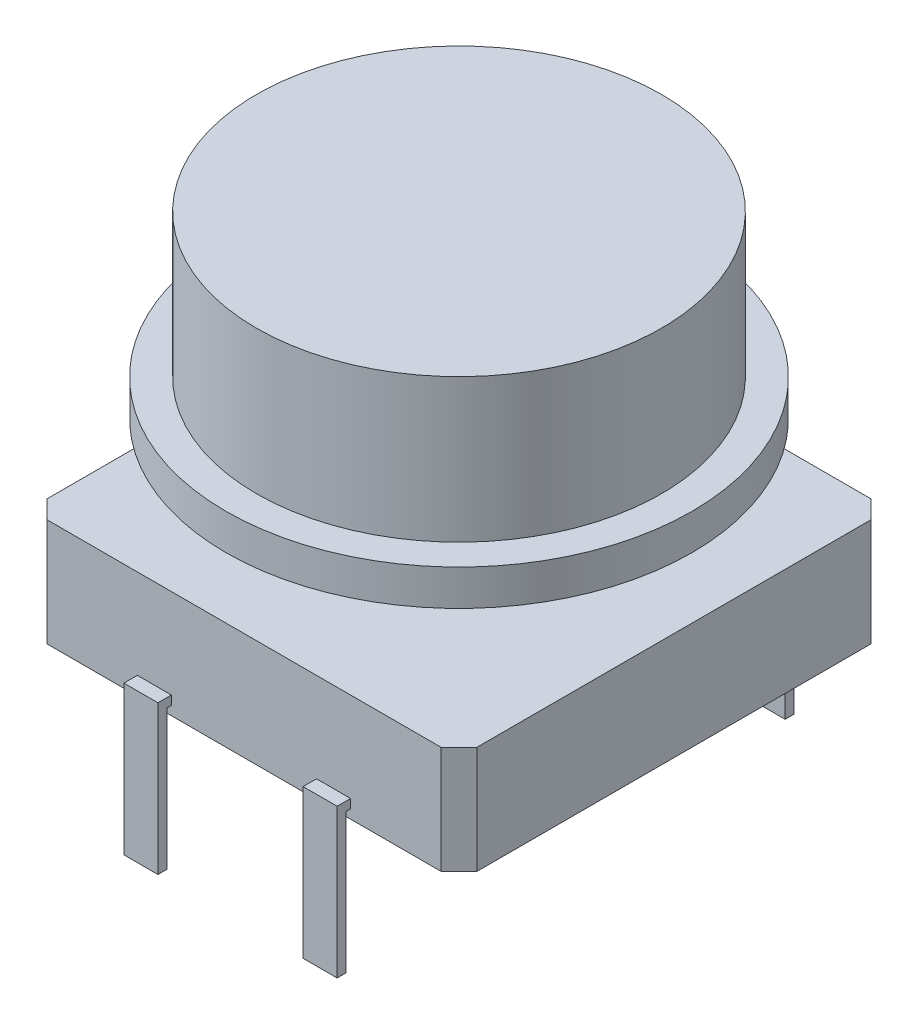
from build123d import *

# Parameters (mm, degrees)
BOSS_EXTRUDE1_DEPTH  = 3
SKETCH2_R            = 3.375
BOSS_EXTRUDE2_DEPTH  = 0.2
SKETCH3_W            = 3.5
SKETCH3_H            = 3.5
BOSS_EXTRUDE3_DEPTH  = 2
SKETCH4_R            = 6.5
BOSS_EXTRUDE4_DEPTH  = 1
SKETCH5_R            = 5.65
BOSS_EXTRUDE5_DEPTH  = 4
BOSS_EXTRUDE6_DEPTH  = 0.95
MIRROR2_COPY_1_DEPTH = 0.95


with BuildPart() as part:
    # Sketch1 → Boss-Extrude1 (new body)
    with BuildSketch(Plane(origin=(0, 0, 0), x_dir=(1, 0, 0), z_dir=(0, 1, 0))):
        Polygon((-5.5, 6), (-6, 5.5), (-6, -5.5), (-5.5, -6), (5.5, -6), (6, -5.5), (6, 5.5), (5.5, 6), align=None)
    extrude(amount=BOSS_EXTRUDE1_DEPTH)

    # Sketch2 → Boss-Extrude2 (add)
    with BuildSketch(Plane(origin=(0, 3, 0), x_dir=(1, 0, 0), z_dir=(0, 1, 0))):
        with Locations(Location((0, 0, 0), (0, 0, 270))):
            Circle(SKETCH2_R)
    extrude(amount=BOSS_EXTRUDE2_DEPTH)

    # Sketch3 → Boss-Extrude3 (add)
    with BuildSketch(Plane(origin=(0, 3.2, 0), x_dir=(1, 0, 0), z_dir=(0, 1, 0))):
        Rectangle(SKETCH3_W, SKETCH3_H)
    extrude(amount=BOSS_EXTRUDE3_DEPTH)

    # Sketch4 → Boss-Extrude4 (add)
    with BuildSketch(Plane(origin=(0, 5.2, 0), x_dir=(1, 0, 0), z_dir=(0, 1, 0))):
        with Locations(Location((0, 0, 0), (0, 0, 270))):
            Circle(SKETCH4_R)
    extrude(amount=BOSS_EXTRUDE4_DEPTH)

    # Sketch5 → Boss-Extrude5 (add)
    with BuildSketch(Plane(origin=(0, 6.2, 0), x_dir=(1, 0, 0), z_dir=(0, 1, 0))):
        with Locations(Location((0, 0, 0), (0, 0, 270))):
            Circle(SKETCH5_R)
    extrude(amount=BOSS_EXTRUDE5_DEPTH)

    # Sketch7 → Boss-Extrude6 (add)
    with BuildSketch(Plane.ZY.offset(2.975)):
        Polygon((6.375, 0.5), (6, 0.5), (6, 0.25), (6.125, 0.25), (6.125, -3.65), (6.375, -3.65), align=None)
    boss_extrude6 = extrude(amount=-BOSS_EXTRUDE6_DEPTH)

    # Mirror1: Boss-Extrude6 across plane
    add(boss_extrude6.mirror(Plane.ZY))

    # Mirror2: Boss-Extrude6 across plane
    add(boss_extrude6.mirror(Plane.XY))

    # Mirror2 copy 1 sketch → Mirror2 copy 1 (add)
    with BuildSketch(Plane(origin=(2.975, 0, 0), x_dir=(0, 0, -1), z_dir=(1, 0, 0))):
        Polygon((6.375, 0.5), (6, 0.5), (6, 0.25), (6.125, 0.25), (6.125, -3.65), (6.375, -3.65), align=None)
    extrude(amount=-MIRROR2_COPY_1_DEPTH)


solid = part.part
